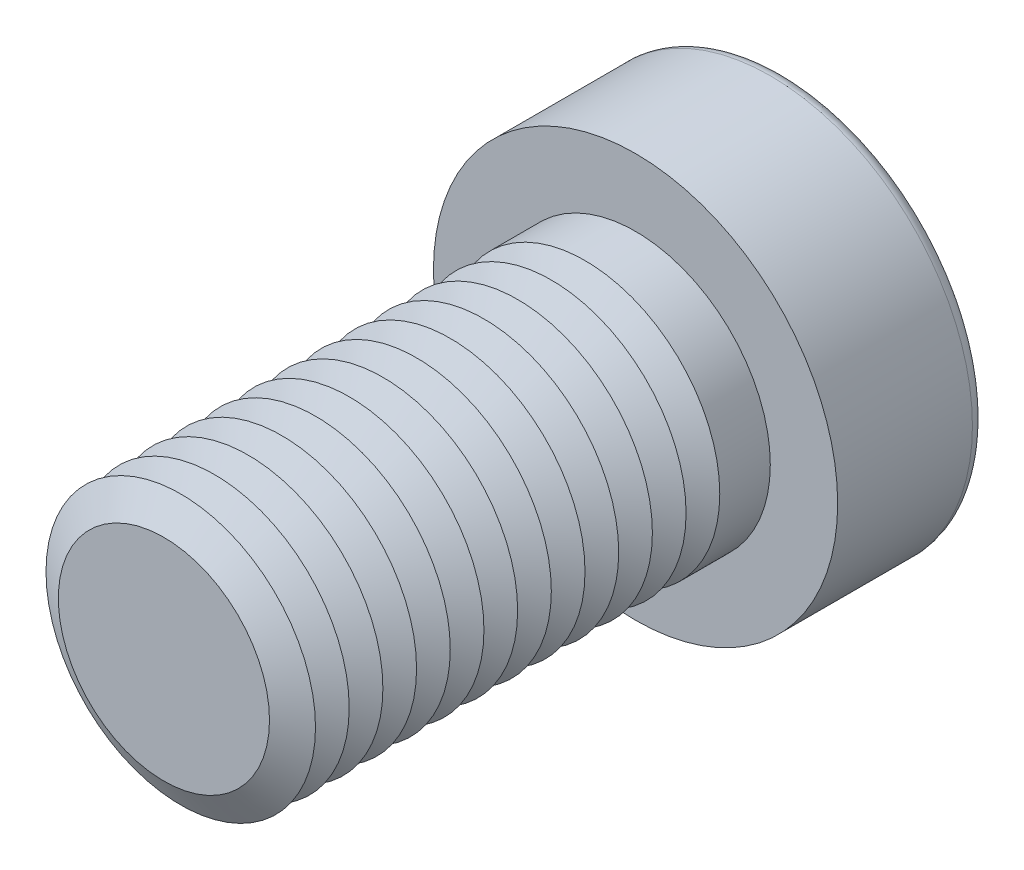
ISO-10303-21;
HEADER;
FILE_DESCRIPTION(('STEP AP214'),'2;1');
FILE_NAME('part.step','',(''),(''),'','','');
FILE_SCHEMA(('AUTOMOTIVE_DESIGN { 1 0 10303 214 1 1 1 1 }'));
ENDSEC;
DATA;
#1=APPLICATION_CONTEXT('core data for automotive mechanical design processes');
#2=APPLICATION_PROTOCOL_DEFINITION('international standard','automotive_design',2000,#1);
#3=PRODUCT_CONTEXT('',#1,'mechanical');
#4=PRODUCT('Part','Part','',(#3));
#5=PRODUCT_RELATED_PRODUCT_CATEGORY('part','',(#4));
#6=PRODUCT_DEFINITION_FORMATION('','',#4);
#7=PRODUCT_DEFINITION_CONTEXT('part definition',#1,'design');
#8=PRODUCT_DEFINITION('design','',#6,#7);
#9=PRODUCT_DEFINITION_SHAPE('','',#8);
#10=(LENGTH_UNIT() NAMED_UNIT(*) SI_UNIT(.MILLI.,.METRE.));
#11=(NAMED_UNIT(*) PLANE_ANGLE_UNIT() SI_UNIT($,.RADIAN.));
#12=(NAMED_UNIT(*) SI_UNIT($,.STERADIAN.) SOLID_ANGLE_UNIT());
#13=UNCERTAINTY_MEASURE_WITH_UNIT(LENGTH_MEASURE(1.E-05),#10,'distance_accuracy_value','');
#14=(GEOMETRIC_REPRESENTATION_CONTEXT(3) GLOBAL_UNCERTAINTY_ASSIGNED_CONTEXT((#13)) GLOBAL_UNIT_ASSIGNED_CONTEXT((#10,
#11,#12)) REPRESENTATION_CONTEXT('',''));
#15=CARTESIAN_POINT('',(0.,0.,0.));
#16=DIRECTION('',(0.,0.,1.));
#17=DIRECTION('',(1.,0.,0.));
#18=AXIS2_PLACEMENT_3D('',#15,#16,#17);
#19=CARTESIAN_POINT('',(0.,0.,26.25));
#20=DIRECTION('',(0.,0.,1.));
#21=DIRECTION('',(1.,0.,0.));
#22=AXIS2_PLACEMENT_3D('',#19,#20,#21);
#23=CONICAL_SURFACE('',#22,10.,1.0471975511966);
#24=CARTESIAN_POINT('',(0.,0.,25.));
#25=DIRECTION('',(0.,0.,1.));
#26=DIRECTION('',(1.,0.,0.));
#27=AXIS2_PLACEMENT_3D('',#24,#25,#26);
#28=CIRCLE('',#27,7.8349364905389);
#29=CARTESIAN_POINT('',(7.8349364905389,0.,25.));
#30=VERTEX_POINT('',#29);
#31=EDGE_CURVE('E313',#30,#30,#28,.T.);
#32=ORIENTED_EDGE('',*,*,#31,.T.);
#33=EDGE_LOOP('',(#32));
#34=FACE_BOUND('',#33,.T.);
#35=CARTESIAN_POINT('',(0.,0.,26.25));
#36=DIRECTION('',(0.,0.,1.));
#37=DIRECTION('',(1.,0.,0.));
#38=AXIS2_PLACEMENT_3D('',#35,#36,#37);
#39=CIRCLE('',#38,10.);
#40=CARTESIAN_POINT('',(10.,0.,26.25));
#41=VERTEX_POINT('',#40);
#42=EDGE_CURVE('E316',#41,#41,#39,.T.);
#43=ORIENTED_EDGE('',*,*,#42,.F.);
#44=EDGE_LOOP('',(#43));
#45=FACE_BOUND('',#44,.T.);
#46=ADVANCED_FACE('F39',(#34,#45),#23,.T.);
#47=CARTESIAN_POINT('',(0.,0.,25.));
#48=DIRECTION('',(0.,0.,-1.));
#49=DIRECTION('',(-1.,0.,0.));
#50=AXIS2_PLACEMENT_3D('',#47,#48,#49);
#51=CONICAL_SURFACE('',#50,7.8349364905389,1.0471975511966);
#52=CARTESIAN_POINT('',(0.,0.,23.75));
#53=DIRECTION('',(0.,0.,1.));
#54=DIRECTION('',(1.,0.,0.));
#55=AXIS2_PLACEMENT_3D('',#52,#53,#54);
#56=CIRCLE('',#55,10.);
#57=CARTESIAN_POINT('',(10.,0.,23.75));
#58=VERTEX_POINT('',#57);
#59=EDGE_CURVE('E324',#58,#58,#56,.T.);
#60=ORIENTED_EDGE('',*,*,#59,.T.);
#61=EDGE_LOOP('',(#60));
#62=FACE_BOUND('',#61,.T.);
#63=ORIENTED_EDGE('',*,*,#31,.F.);
#64=EDGE_LOOP('',(#63));
#65=FACE_BOUND('',#64,.T.);
#66=ADVANCED_FACE('F245',(#62,#65),#51,.T.);
#67=CARTESIAN_POINT('',(0.,0.,35.));
#68=DIRECTION('',(0.,0.,1.));
#69=DIRECTION('',(1.,0.,0.));
#70=AXIS2_PLACEMENT_3D('',#67,#68,#69);
#71=PLANE('',#70);
#72=CARTESIAN_POINT('',(0.,0.,35.));
#73=DIRECTION('',(0.,0.,1.));
#74=DIRECTION('',(1.,0.,0.));
#75=AXIS2_PLACEMENT_3D('',#72,#73,#74);
#76=CIRCLE('',#75,7.8349364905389);
#77=CARTESIAN_POINT('',(7.8349364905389,0.,35.));
#78=VERTEX_POINT('',#77);
#79=EDGE_CURVE('E174',#78,#78,#76,.T.);
#80=ORIENTED_EDGE('',*,*,#79,.T.);
#81=EDGE_LOOP('',(#80));
#82=FACE_BOUND('',#81,.T.);
#83=ADVANCED_FACE('F251',(#82),#71,.T.);
#84=CARTESIAN_POINT('',(0.,0.,35.));
#85=DIRECTION('',(0.,0.,-1.));
#86=DIRECTION('',(-1.,0.,0.));
#87=AXIS2_PLACEMENT_3D('',#84,#85,#86);
#88=CONICAL_SURFACE('',#87,7.8349364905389,1.0471975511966);
#89=CARTESIAN_POINT('',(0.,0.,33.75));
#90=DIRECTION('',(0.,0.,1.));
#91=DIRECTION('',(1.,0.,0.));
#92=AXIS2_PLACEMENT_3D('',#89,#90,#91);
#93=CIRCLE('',#92,10.);
#94=CARTESIAN_POINT('',(10.,0.,33.75));
#95=VERTEX_POINT('',#94);
#96=EDGE_CURVE('E291',#95,#95,#93,.T.);
#97=ORIENTED_EDGE('',*,*,#96,.T.);
#98=EDGE_LOOP('',(#97));
#99=FACE_BOUND('',#98,.T.);
#100=ORIENTED_EDGE('',*,*,#79,.F.);
#101=EDGE_LOOP('',(#100));
#102=FACE_BOUND('',#101,.T.);
#103=ADVANCED_FACE('F199',(#99,#102),#88,.T.);
#104=CARTESIAN_POINT('',(0.,0.,33.75));
#105=DIRECTION('',(0.,0.,1.));
#106=DIRECTION('',(1.,0.,0.));
#107=AXIS2_PLACEMENT_3D('',#104,#105,#106);
#108=CONICAL_SURFACE('',#107,10.,1.0471975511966);
#109=CARTESIAN_POINT('',(0.,0.,32.5));
#110=DIRECTION('',(0.,0.,1.));
#111=DIRECTION('',(1.,0.,0.));
#112=AXIS2_PLACEMENT_3D('',#109,#110,#111);
#113=CIRCLE('',#112,7.8349364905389);
#114=CARTESIAN_POINT('',(7.8349364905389,0.,32.5));
#115=VERTEX_POINT('',#114);
#116=EDGE_CURVE('E288',#115,#115,#113,.T.);
#117=ORIENTED_EDGE('',*,*,#116,.T.);
#118=EDGE_LOOP('',(#117));
#119=FACE_BOUND('',#118,.T.);
#120=ORIENTED_EDGE('',*,*,#96,.F.);
#121=EDGE_LOOP('',(#120));
#122=FACE_BOUND('',#121,.T.);
#123=ADVANCED_FACE('F277',(#119,#122),#108,.T.);
#124=CARTESIAN_POINT('',(0.,0.,32.5));
#125=DIRECTION('',(0.,0.,-1.));
#126=DIRECTION('',(-1.,0.,0.));
#127=AXIS2_PLACEMENT_3D('',#124,#125,#126);
#128=CONICAL_SURFACE('',#127,7.8349364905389,1.0471975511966);
#129=CARTESIAN_POINT('',(0.,0.,31.25));
#130=DIRECTION('',(0.,0.,1.));
#131=DIRECTION('',(1.,0.,0.));
#132=AXIS2_PLACEMENT_3D('',#129,#130,#131);
#133=CIRCLE('',#132,10.);
#134=CARTESIAN_POINT('',(10.,0.,31.25));
#135=VERTEX_POINT('',#134);
#136=EDGE_CURVE('E300',#135,#135,#133,.T.);
#137=ORIENTED_EDGE('',*,*,#136,.T.);
#138=EDGE_LOOP('',(#137));
#139=FACE_BOUND('',#138,.T.);
#140=ORIENTED_EDGE('',*,*,#116,.F.);
#141=EDGE_LOOP('',(#140));
#142=FACE_BOUND('',#141,.T.);
#143=ADVANCED_FACE('F274',(#139,#142),#128,.T.);
#144=CARTESIAN_POINT('',(0.,0.,31.25));
#145=DIRECTION('',(0.,0.,1.));
#146=DIRECTION('',(1.,0.,0.));
#147=AXIS2_PLACEMENT_3D('',#144,#145,#146);
#148=CONICAL_SURFACE('',#147,10.,1.0471975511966);
#149=CARTESIAN_POINT('',(0.,0.,30.));
#150=DIRECTION('',(0.,0.,1.));
#151=DIRECTION('',(1.,0.,0.));
#152=AXIS2_PLACEMENT_3D('',#149,#150,#151);
#153=CIRCLE('',#152,7.8349364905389);
#154=CARTESIAN_POINT('',(7.8349364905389,0.,30.));
#155=VERTEX_POINT('',#154);
#156=EDGE_CURVE('E293',#155,#155,#153,.T.);
#157=ORIENTED_EDGE('',*,*,#156,.T.);
#158=EDGE_LOOP('',(#157));
#159=FACE_BOUND('',#158,.T.);
#160=ORIENTED_EDGE('',*,*,#136,.F.);
#161=EDGE_LOOP('',(#160));
#162=FACE_BOUND('',#161,.T.);
#163=ADVANCED_FACE('F270',(#159,#162),#148,.T.);
#164=CARTESIAN_POINT('',(0.,0.,30.));
#165=DIRECTION('',(0.,0.,-1.));
#166=DIRECTION('',(-1.,0.,0.));
#167=AXIS2_PLACEMENT_3D('',#164,#165,#166);
#168=CONICAL_SURFACE('',#167,7.8349364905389,1.0471975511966);
#169=CARTESIAN_POINT('',(0.,0.,28.75));
#170=DIRECTION('',(0.,0.,1.));
#171=DIRECTION('',(1.,0.,0.));
#172=AXIS2_PLACEMENT_3D('',#169,#170,#171);
#173=CIRCLE('',#172,10.);
#174=CARTESIAN_POINT('',(10.,0.,28.75));
#175=VERTEX_POINT('',#174);
#176=EDGE_CURVE('E309',#175,#175,#173,.T.);
#177=ORIENTED_EDGE('',*,*,#176,.T.);
#178=EDGE_LOOP('',(#177));
#179=FACE_BOUND('',#178,.T.);
#180=ORIENTED_EDGE('',*,*,#156,.F.);
#181=EDGE_LOOP('',(#180));
#182=FACE_BOUND('',#181,.T.);
#183=ADVANCED_FACE('F266',(#179,#182),#168,.T.);
#184=CARTESIAN_POINT('',(0.,0.,28.75));
#185=DIRECTION('',(0.,0.,1.));
#186=DIRECTION('',(1.,0.,0.));
#187=AXIS2_PLACEMENT_3D('',#184,#185,#186);
#188=CONICAL_SURFACE('',#187,10.,1.0471975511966);
#189=CARTESIAN_POINT('',(0.,0.,27.5));
#190=DIRECTION('',(0.,0.,1.));
#191=DIRECTION('',(1.,0.,0.));
#192=AXIS2_PLACEMENT_3D('',#189,#190,#191);
#193=CIRCLE('',#192,7.8349364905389);
#194=CARTESIAN_POINT('',(7.8349364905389,0.,27.5));
#195=VERTEX_POINT('',#194);
#196=EDGE_CURVE('E306',#195,#195,#193,.T.);
#197=ORIENTED_EDGE('',*,*,#196,.T.);
#198=EDGE_LOOP('',(#197));
#199=FACE_BOUND('',#198,.T.);
#200=ORIENTED_EDGE('',*,*,#176,.F.);
#201=EDGE_LOOP('',(#200));
#202=FACE_BOUND('',#201,.T.);
#203=ADVANCED_FACE('F262',(#199,#202),#188,.T.);
#204=CARTESIAN_POINT('',(0.,0.,27.5));
#205=DIRECTION('',(0.,0.,-1.));
#206=DIRECTION('',(-1.,0.,0.));
#207=AXIS2_PLACEMENT_3D('',#204,#205,#206);
#208=CONICAL_SURFACE('',#207,7.8349364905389,1.0471975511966);
#209=ORIENTED_EDGE('',*,*,#42,.T.);
#210=EDGE_LOOP('',(#209));
#211=FACE_BOUND('',#210,.T.);
#212=ORIENTED_EDGE('',*,*,#196,.F.);
#213=EDGE_LOOP('',(#212));
#214=FACE_BOUND('',#213,.T.);
#215=ADVANCED_FACE('F258',(#211,#214),#208,.T.);
#216=CARTESIAN_POINT('',(0.,0.,23.75));
#217=DIRECTION('',(0.,0.,1.));
#218=DIRECTION('',(1.,0.,0.));
#219=AXIS2_PLACEMENT_3D('',#216,#217,#218);
#220=CONICAL_SURFACE('',#219,10.,1.0471975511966);
#221=CARTESIAN_POINT('',(0.,0.,22.5));
#222=DIRECTION('',(0.,0.,1.));
#223=DIRECTION('',(1.,0.,0.));
#224=AXIS2_PLACEMENT_3D('',#221,#222,#223);
#225=CIRCLE('',#224,7.8349364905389);
#226=CARTESIAN_POINT('',(7.8349364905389,0.,22.5));
#227=VERTEX_POINT('',#226);
#228=EDGE_CURVE('E320',#227,#227,#225,.T.);
#229=ORIENTED_EDGE('',*,*,#228,.T.);
#230=EDGE_LOOP('',(#229));
#231=FACE_BOUND('',#230,.T.);
#232=ORIENTED_EDGE('',*,*,#59,.F.);
#233=EDGE_LOOP('',(#232));
#234=FACE_BOUND('',#233,.T.);
#235=ADVANCED_FACE('F261',(#231,#234),#220,.T.);
#236=CARTESIAN_POINT('',(0.,0.,22.5));
#237=DIRECTION('',(0.,0.,-1.));
#238=DIRECTION('',(-1.,0.,0.));
#239=AXIS2_PLACEMENT_3D('',#236,#237,#238);
#240=CONICAL_SURFACE('',#239,7.8349364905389,1.0471975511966);
#241=CARTESIAN_POINT('',(0.,0.,21.25));
#242=DIRECTION('',(0.,0.,1.));
#243=DIRECTION('',(1.,0.,0.));
#244=AXIS2_PLACEMENT_3D('',#241,#242,#243);
#245=CIRCLE('',#244,10.);
#246=CARTESIAN_POINT('',(10.,0.,21.25));
#247=VERTEX_POINT('',#246);
#248=EDGE_CURVE('E331',#247,#247,#245,.T.);
#249=ORIENTED_EDGE('',*,*,#248,.T.);
#250=EDGE_LOOP('',(#249));
#251=FACE_BOUND('',#250,.T.);
#252=ORIENTED_EDGE('',*,*,#228,.F.);
#253=EDGE_LOOP('',(#252));
#254=FACE_BOUND('',#253,.T.);
#255=ADVANCED_FACE('F449',(#251,#254),#240,.T.);
#256=CARTESIAN_POINT('',(0.,0.,21.25));
#257=DIRECTION('',(0.,0.,1.));
#258=DIRECTION('',(1.,0.,0.));
#259=AXIS2_PLACEMENT_3D('',#256,#257,#258);
#260=CONICAL_SURFACE('',#259,10.,1.0471975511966);
#261=CARTESIAN_POINT('',(0.,0.,20.));
#262=DIRECTION('',(0.,0.,1.));
#263=DIRECTION('',(1.,0.,0.));
#264=AXIS2_PLACEMENT_3D('',#261,#262,#263);
#265=CIRCLE('',#264,7.8349364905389);
#266=CARTESIAN_POINT('',(7.8349364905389,0.,20.));
#267=VERTEX_POINT('',#266);
#268=EDGE_CURVE('E328',#267,#267,#265,.T.);
#269=ORIENTED_EDGE('',*,*,#268,.T.);
#270=EDGE_LOOP('',(#269));
#271=FACE_BOUND('',#270,.T.);
#272=ORIENTED_EDGE('',*,*,#248,.F.);
#273=EDGE_LOOP('',(#272));
#274=FACE_BOUND('',#273,.T.);
#275=ADVANCED_FACE('F445',(#271,#274),#260,.T.);
#276=CARTESIAN_POINT('',(0.,0.,20.));
#277=DIRECTION('',(0.,0.,-1.));
#278=DIRECTION('',(-1.,0.,0.));
#279=AXIS2_PLACEMENT_3D('',#276,#277,#278);
#280=CONICAL_SURFACE('',#279,7.8349364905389,1.0471975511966);
#281=CARTESIAN_POINT('',(0.,0.,18.75));
#282=DIRECTION('',(0.,0.,1.));
#283=DIRECTION('',(1.,0.,0.));
#284=AXIS2_PLACEMENT_3D('',#281,#282,#283);
#285=CIRCLE('',#284,10.);
#286=CARTESIAN_POINT('',(10.,0.,18.75));
#287=VERTEX_POINT('',#286);
#288=EDGE_CURVE('E339',#287,#287,#285,.T.);
#289=ORIENTED_EDGE('',*,*,#288,.T.);
#290=EDGE_LOOP('',(#289));
#291=FACE_BOUND('',#290,.T.);
#292=ORIENTED_EDGE('',*,*,#268,.F.);
#293=EDGE_LOOP('',(#292));
#294=FACE_BOUND('',#293,.T.);
#295=ADVANCED_FACE('F441',(#291,#294),#280,.T.);
#296=CARTESIAN_POINT('',(0.,0.,18.75));
#297=DIRECTION('',(0.,0.,1.));
#298=DIRECTION('',(1.,0.,0.));
#299=AXIS2_PLACEMENT_3D('',#296,#297,#298);
#300=CONICAL_SURFACE('',#299,10.,1.0471975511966);
#301=CARTESIAN_POINT('',(0.,0.,17.5));
#302=DIRECTION('',(0.,0.,1.));
#303=DIRECTION('',(1.,0.,0.));
#304=AXIS2_PLACEMENT_3D('',#301,#302,#303);
#305=CIRCLE('',#304,7.8349364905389);
#306=CARTESIAN_POINT('',(7.8349364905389,0.,17.5));
#307=VERTEX_POINT('',#306);
#308=EDGE_CURVE('E335',#307,#307,#305,.T.);
#309=ORIENTED_EDGE('',*,*,#308,.T.);
#310=EDGE_LOOP('',(#309));
#311=FACE_BOUND('',#310,.T.);
#312=ORIENTED_EDGE('',*,*,#288,.F.);
#313=EDGE_LOOP('',(#312));
#314=FACE_BOUND('',#313,.T.);
#315=ADVANCED_FACE('F437',(#311,#314),#300,.T.);
#316=CARTESIAN_POINT('',(0.,0.,17.5));
#317=DIRECTION('',(0.,0.,-1.));
#318=DIRECTION('',(-1.,0.,0.));
#319=AXIS2_PLACEMENT_3D('',#316,#317,#318);
#320=CONICAL_SURFACE('',#319,7.8349364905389,1.0471975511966);
#321=CARTESIAN_POINT('',(0.,0.,16.25));
#322=DIRECTION('',(0.,0.,1.));
#323=DIRECTION('',(1.,0.,0.));
#324=AXIS2_PLACEMENT_3D('',#321,#322,#323);
#325=CIRCLE('',#324,10.);
#326=CARTESIAN_POINT('',(10.,0.,16.25));
#327=VERTEX_POINT('',#326);
#328=EDGE_CURVE('E347',#327,#327,#325,.T.);
#329=ORIENTED_EDGE('',*,*,#328,.T.);
#330=EDGE_LOOP('',(#329));
#331=FACE_BOUND('',#330,.T.);
#332=ORIENTED_EDGE('',*,*,#308,.F.);
#333=EDGE_LOOP('',(#332));
#334=FACE_BOUND('',#333,.T.);
#335=ADVANCED_FACE('F433',(#331,#334),#320,.T.);
#336=CARTESIAN_POINT('',(0.,0.,16.25));
#337=DIRECTION('',(0.,0.,1.));
#338=DIRECTION('',(1.,0.,0.));
#339=AXIS2_PLACEMENT_3D('',#336,#337,#338);
#340=CONICAL_SURFACE('',#339,10.,1.0471975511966);
#341=CARTESIAN_POINT('',(0.,0.,15.));
#342=DIRECTION('',(0.,0.,1.));
#343=DIRECTION('',(1.,0.,0.));
#344=AXIS2_PLACEMENT_3D('',#341,#342,#343);
#345=CIRCLE('',#344,7.8349364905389);
#346=CARTESIAN_POINT('',(7.8349364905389,0.,15.));
#347=VERTEX_POINT('',#346);
#348=EDGE_CURVE('E343',#347,#347,#345,.T.);
#349=ORIENTED_EDGE('',*,*,#348,.T.);
#350=EDGE_LOOP('',(#349));
#351=FACE_BOUND('',#350,.T.);
#352=ORIENTED_EDGE('',*,*,#328,.F.);
#353=EDGE_LOOP('',(#352));
#354=FACE_BOUND('',#353,.T.);
#355=ADVANCED_FACE('F429',(#351,#354),#340,.T.);
#356=CARTESIAN_POINT('',(0.,0.,15.));
#357=DIRECTION('',(0.,0.,-1.));
#358=DIRECTION('',(-1.,0.,0.));
#359=AXIS2_PLACEMENT_3D('',#356,#357,#358);
#360=CONICAL_SURFACE('',#359,7.8349364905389,1.0471975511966);
#361=CARTESIAN_POINT('',(0.,0.,13.75));
#362=DIRECTION('',(0.,0.,1.));
#363=DIRECTION('',(1.,0.,0.));
#364=AXIS2_PLACEMENT_3D('',#361,#362,#363);
#365=CIRCLE('',#364,10.);
#366=CARTESIAN_POINT('',(10.,0.,13.75));
#367=VERTEX_POINT('',#366);
#368=EDGE_CURVE('E355',#367,#367,#365,.T.);
#369=ORIENTED_EDGE('',*,*,#368,.T.);
#370=EDGE_LOOP('',(#369));
#371=FACE_BOUND('',#370,.T.);
#372=ORIENTED_EDGE('',*,*,#348,.F.);
#373=EDGE_LOOP('',(#372));
#374=FACE_BOUND('',#373,.T.);
#375=ADVANCED_FACE('F425',(#371,#374),#360,.T.);
#376=CARTESIAN_POINT('',(0.,0.,13.75));
#377=DIRECTION('',(0.,0.,1.));
#378=DIRECTION('',(1.,0.,0.));
#379=AXIS2_PLACEMENT_3D('',#376,#377,#378);
#380=CONICAL_SURFACE('',#379,10.,1.0471975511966);
#381=CARTESIAN_POINT('',(0.,0.,12.5));
#382=DIRECTION('',(0.,0.,1.));
#383=DIRECTION('',(1.,0.,0.));
#384=AXIS2_PLACEMENT_3D('',#381,#382,#383);
#385=CIRCLE('',#384,7.8349364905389);
#386=CARTESIAN_POINT('',(7.8349364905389,0.,12.5));
#387=VERTEX_POINT('',#386);
#388=EDGE_CURVE('E351',#387,#387,#385,.T.);
#389=ORIENTED_EDGE('',*,*,#388,.T.);
#390=EDGE_LOOP('',(#389));
#391=FACE_BOUND('',#390,.T.);
#392=ORIENTED_EDGE('',*,*,#368,.F.);
#393=EDGE_LOOP('',(#392));
#394=FACE_BOUND('',#393,.T.);
#395=ADVANCED_FACE('F421',(#391,#394),#380,.T.);
#396=CARTESIAN_POINT('',(0.,0.,12.5));
#397=DIRECTION('',(0.,0.,-1.));
#398=DIRECTION('',(-1.,0.,0.));
#399=AXIS2_PLACEMENT_3D('',#396,#397,#398);
#400=CONICAL_SURFACE('',#399,7.8349364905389,1.0471975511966);
#401=CARTESIAN_POINT('',(0.,0.,11.25));
#402=DIRECTION('',(0.,0.,1.));
#403=DIRECTION('',(1.,0.,0.));
#404=AXIS2_PLACEMENT_3D('',#401,#402,#403);
#405=CIRCLE('',#404,10.);
#406=CARTESIAN_POINT('',(10.,0.,11.25));
#407=VERTEX_POINT('',#406);
#408=EDGE_CURVE('E363',#407,#407,#405,.T.);
#409=ORIENTED_EDGE('',*,*,#408,.T.);
#410=EDGE_LOOP('',(#409));
#411=FACE_BOUND('',#410,.T.);
#412=ORIENTED_EDGE('',*,*,#388,.F.);
#413=EDGE_LOOP('',(#412));
#414=FACE_BOUND('',#413,.T.);
#415=ADVANCED_FACE('F417',(#411,#414),#400,.T.);
#416=CARTESIAN_POINT('',(0.,0.,11.25));
#417=DIRECTION('',(0.,0.,1.));
#418=DIRECTION('',(1.,0.,0.));
#419=AXIS2_PLACEMENT_3D('',#416,#417,#418);
#420=CONICAL_SURFACE('',#419,10.,1.0471975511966);
#421=CARTESIAN_POINT('',(0.,0.,10.));
#422=DIRECTION('',(0.,0.,1.));
#423=DIRECTION('',(1.,0.,0.));
#424=AXIS2_PLACEMENT_3D('',#421,#422,#423);
#425=CIRCLE('',#424,7.8349364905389);
#426=CARTESIAN_POINT('',(7.8349364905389,0.,10.));
#427=VERTEX_POINT('',#426);
#428=EDGE_CURVE('E359',#427,#427,#425,.T.);
#429=ORIENTED_EDGE('',*,*,#428,.T.);
#430=EDGE_LOOP('',(#429));
#431=FACE_BOUND('',#430,.T.);
#432=ORIENTED_EDGE('',*,*,#408,.F.);
#433=EDGE_LOOP('',(#432));
#434=FACE_BOUND('',#433,.T.);
#435=ADVANCED_FACE('F413',(#431,#434),#420,.T.);
#436=CARTESIAN_POINT('',(0.,0.,10.));
#437=DIRECTION('',(0.,0.,-1.));
#438=DIRECTION('',(-1.,0.,0.));
#439=AXIS2_PLACEMENT_3D('',#436,#437,#438);
#440=CONICAL_SURFACE('',#439,7.8349364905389,1.0471975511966);
#441=CARTESIAN_POINT('',(0.,0.,8.75));
#442=DIRECTION('',(0.,0.,1.));
#443=DIRECTION('',(1.,0.,0.));
#444=AXIS2_PLACEMENT_3D('',#441,#442,#443);
#445=CIRCLE('',#444,10.);
#446=CARTESIAN_POINT('',(10.,0.,8.75));
#447=VERTEX_POINT('',#446);
#448=EDGE_CURVE('E371',#447,#447,#445,.T.);
#449=ORIENTED_EDGE('',*,*,#448,.T.);
#450=EDGE_LOOP('',(#449));
#451=FACE_BOUND('',#450,.T.);
#452=ORIENTED_EDGE('',*,*,#428,.F.);
#453=EDGE_LOOP('',(#452));
#454=FACE_BOUND('',#453,.T.);
#455=ADVANCED_FACE('F409',(#451,#454),#440,.T.);
#456=CARTESIAN_POINT('',(0.,0.,8.75));
#457=DIRECTION('',(0.,0.,1.));
#458=DIRECTION('',(1.,0.,0.));
#459=AXIS2_PLACEMENT_3D('',#456,#457,#458);
#460=CONICAL_SURFACE('',#459,10.,1.0471975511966);
#461=CARTESIAN_POINT('',(0.,0.,7.5));
#462=DIRECTION('',(0.,0.,1.));
#463=DIRECTION('',(1.,0.,0.));
#464=AXIS2_PLACEMENT_3D('',#461,#462,#463);
#465=CIRCLE('',#464,7.8349364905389);
#466=CARTESIAN_POINT('',(7.8349364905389,0.,7.5));
#467=VERTEX_POINT('',#466);
#468=EDGE_CURVE('E367',#467,#467,#465,.T.);
#469=ORIENTED_EDGE('',*,*,#468,.T.);
#470=EDGE_LOOP('',(#469));
#471=FACE_BOUND('',#470,.T.);
#472=ORIENTED_EDGE('',*,*,#448,.F.);
#473=EDGE_LOOP('',(#472));
#474=FACE_BOUND('',#473,.T.);
#475=ADVANCED_FACE('F404',(#471,#474),#460,.T.);
#476=CARTESIAN_POINT('',(0.,0.,7.5));
#477=DIRECTION('',(0.,0.,-1.));
#478=DIRECTION('',(-1.,0.,0.));
#479=AXIS2_PLACEMENT_3D('',#476,#477,#478);
#480=CONICAL_SURFACE('',#479,7.8349364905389,1.0471975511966);
#481=CARTESIAN_POINT('',(0.,0.,6.25000000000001));
#482=DIRECTION('',(0.,0.,1.));
#483=DIRECTION('',(1.,0.,0.));
#484=AXIS2_PLACEMENT_3D('',#481,#482,#483);
#485=CIRCLE('',#484,10.);
#486=CARTESIAN_POINT('',(10.,0.,6.25000000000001));
#487=VERTEX_POINT('',#486);
#488=EDGE_CURVE('E383',#487,#487,#485,.T.);
#489=ORIENTED_EDGE('',*,*,#488,.T.);
#490=EDGE_LOOP('',(#489));
#491=FACE_BOUND('',#490,.T.);
#492=ORIENTED_EDGE('',*,*,#468,.F.);
#493=EDGE_LOOP('',(#492));
#494=FACE_BOUND('',#493,.T.);
#495=ADVANCED_FACE('F390',(#491,#494),#480,.T.);
#496=CARTESIAN_POINT('',(0.,0.,6.25000000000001));
#497=DIRECTION('',(0.,0.,1.));
#498=DIRECTION('',(1.,0.,0.));
#499=AXIS2_PLACEMENT_3D('',#496,#497,#498);
#500=CONICAL_SURFACE('',#499,10.,1.0471975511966);
#501=CARTESIAN_POINT('',(0.,0.,5.));
#502=DIRECTION('',(0.,0.,1.));
#503=DIRECTION('',(1.,0.,0.));
#504=AXIS2_PLACEMENT_3D('',#501,#502,#503);
#505=CIRCLE('',#504,7.8349364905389);
#506=CARTESIAN_POINT('',(7.8349364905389,0.,5.));
#507=VERTEX_POINT('',#506);
#508=EDGE_CURVE('E375',#507,#507,#505,.T.);
#509=ORIENTED_EDGE('',*,*,#508,.T.);
#510=EDGE_LOOP('',(#509));
#511=FACE_BOUND('',#510,.T.);
#512=ORIENTED_EDGE('',*,*,#488,.F.);
#513=EDGE_LOOP('',(#512));
#514=FACE_BOUND('',#513,.T.);
#515=ADVANCED_FACE('F393',(#511,#514),#500,.T.);
#516=CARTESIAN_POINT('',(0.,0.,5.));
#517=DIRECTION('',(0.,0.,-1.));
#518=DIRECTION('',(-1.,0.,0.));
#519=AXIS2_PLACEMENT_3D('',#516,#517,#518);
#520=CONICAL_SURFACE('',#519,7.8349364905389,1.0471975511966);
#521=CARTESIAN_POINT('',(0.,0.,3.75));
#522=DIRECTION('',(0.,0.,1.));
#523=DIRECTION('',(1.,0.,0.));
#524=AXIS2_PLACEMENT_3D('',#521,#522,#523);
#525=CIRCLE('',#524,10.);
#526=CARTESIAN_POINT('',(10.,0.,3.75));
#527=VERTEX_POINT('',#526);
#528=EDGE_CURVE('E379',#527,#527,#525,.T.);
#529=ORIENTED_EDGE('',*,*,#528,.T.);
#530=EDGE_LOOP('',(#529));
#531=FACE_BOUND('',#530,.T.);
#532=ORIENTED_EDGE('',*,*,#508,.F.);
#533=EDGE_LOOP('',(#532));
#534=FACE_BOUND('',#533,.T.);
#535=ADVANCED_FACE('F395',(#531,#534),#520,.T.);
#536=CARTESIAN_POINT('',(0.,0.,-0.499999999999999));
#537=DIRECTION('',(0.,0.,-1.));
#538=DIRECTION('',(-1.,0.,0.));
#539=AXIS2_PLACEMENT_3D('',#536,#537,#538);
#540=CONICAL_SURFACE('',#539,7.,1.0471975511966);
#541=CARTESIAN_POINT('',(0.,0.,3.54145188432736));
#542=VERTEX_POINT('',#541);
#543=VERTEX_LOOP('',#542);
#544=FACE_BOUND('',#543,.T.);
#545=CARTESIAN_POINT('',(0.,0.,-0.499999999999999));
#546=DIRECTION('',(0.,0.,-1.));
#547=DIRECTION('',(-1.,0.,0.));
#548=AXIS2_PLACEMENT_3D('',#545,#546,#547);
#549=CIRCLE('',#548,7.);
#550=CARTESIAN_POINT('',(-6.06217782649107,3.5,-0.499999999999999));
#551=VERTEX_POINT('',#550);
#552=CARTESIAN_POINT('',(0.,7.,-0.499999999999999));
#553=VERTEX_POINT('',#552);
#554=EDGE_CURVE('E149',#551,#553,#549,.T.);
#555=ORIENTED_EDGE('',*,*,#554,.T.);
#556=CARTESIAN_POINT('',(0.,0.,-0.499999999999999));
#557=DIRECTION('',(0.,0.,-1.));
#558=DIRECTION('',(-1.,0.,0.));
#559=AXIS2_PLACEMENT_3D('',#556,#557,#558);
#560=CIRCLE('',#559,7.);
#561=CARTESIAN_POINT('',(6.06217782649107,3.5,-0.499999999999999));
#562=VERTEX_POINT('',#561);
#563=EDGE_CURVE('E54',#553,#562,#560,.T.);
#564=ORIENTED_EDGE('',*,*,#563,.T.);
#565=CARTESIAN_POINT('',(6.06217782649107,-3.5,-0.499999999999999));
#566=VERTEX_POINT('',#565);
#567=EDGE_CURVE('E906',#562,#566,#560,.T.);
#568=ORIENTED_EDGE('',*,*,#567,.T.);
#569=CARTESIAN_POINT('',(0.,-7.,-0.499999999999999));
#570=VERTEX_POINT('',#569);
#571=EDGE_CURVE('E904',#566,#570,#560,.T.);
#572=ORIENTED_EDGE('',*,*,#571,.T.);
#573=CARTESIAN_POINT('',(-6.06217782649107,-3.5,-0.499999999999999));
#574=VERTEX_POINT('',#573);
#575=EDGE_CURVE('E899',#570,#574,#560,.T.);
#576=ORIENTED_EDGE('',*,*,#575,.T.);
#577=EDGE_CURVE('E897',#574,#551,#560,.T.);
#578=ORIENTED_EDGE('',*,*,#577,.T.);
#579=EDGE_LOOP('',(#555,#564,#568,#572,#576,#578));
#580=FACE_BOUND('',#579,.T.);
#581=ADVANCED_FACE('F201',(#544,#580),#540,.F.);
#582=CARTESIAN_POINT('',(0.,0.,-0.499999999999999));
#583=DIRECTION('',(0.,0.,-1.));
#584=DIRECTION('',(-1.,0.,0.));
#585=AXIS2_PLACEMENT_3D('',#582,#583,#584);
#586=PLANE('',#585);
#587=ORIENTED_EDGE('',*,*,#563,.F.);
#588=DIRECTION('',(1.,0.,0.));
#589=VECTOR('',#588,1.);
#590=CARTESIAN_POINT('',(-4.04145188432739,7.,-0.499999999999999));
#591=LINE('',#590,#589);
#592=CARTESIAN_POINT('',(4.04145188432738,7.,-0.499999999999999));
#593=VERTEX_POINT('',#592);
#594=EDGE_CURVE('E947',#553,#593,#591,.T.);
#595=ORIENTED_EDGE('',*,*,#594,.T.);
#596=DIRECTION('',(0.5,-0.866025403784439,0.));
#597=VECTOR('',#596,1.);
#598=CARTESIAN_POINT('',(4.04145188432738,7.,-0.499999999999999));
#599=LINE('',#598,#597);
#600=EDGE_CURVE('E155',#593,#562,#599,.T.);
#601=ORIENTED_EDGE('',*,*,#600,.T.);
#602=EDGE_LOOP('',(#587,#595,#601));
#603=FACE_BOUND('',#602,.T.);
#604=ADVANCED_FACE('F520',(#603),#586,.T.);
#605=ORIENTED_EDGE('',*,*,#567,.F.);
#606=CARTESIAN_POINT('',(8.08290376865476,0.,-0.499999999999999));
#607=VERTEX_POINT('',#606);
#608=EDGE_CURVE('E946',#562,#607,#599,.T.);
#609=ORIENTED_EDGE('',*,*,#608,.T.);
#610=DIRECTION('',(-0.5,-0.866025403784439,0.));
#611=VECTOR('',#610,1.);
#612=CARTESIAN_POINT('',(8.08290376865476,0.,-0.499999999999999));
#613=LINE('',#612,#611);
#614=EDGE_CURVE('E920',#607,#566,#613,.T.);
#615=ORIENTED_EDGE('',*,*,#614,.T.);
#616=EDGE_LOOP('',(#605,#609,#615));
#617=FACE_BOUND('',#616,.T.);
#618=ADVANCED_FACE('F530',(#617),#586,.T.);
#619=ORIENTED_EDGE('',*,*,#571,.F.);
#620=CARTESIAN_POINT('',(4.04145188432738,-7.,-0.499999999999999));
#621=VERTEX_POINT('',#620);
#622=EDGE_CURVE('E922',#566,#621,#613,.T.);
#623=ORIENTED_EDGE('',*,*,#622,.T.);
#624=DIRECTION('',(-1.,0.,0.));
#625=VECTOR('',#624,1.);
#626=CARTESIAN_POINT('',(4.04145188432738,-7.,-0.499999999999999));
#627=LINE('',#626,#625);
#628=EDGE_CURVE('E871',#621,#570,#627,.T.);
#629=ORIENTED_EDGE('',*,*,#628,.T.);
#630=EDGE_LOOP('',(#619,#623,#629));
#631=FACE_BOUND('',#630,.T.);
#632=ADVANCED_FACE('F540',(#631),#586,.T.);
#633=ORIENTED_EDGE('',*,*,#575,.F.);
#634=CARTESIAN_POINT('',(-4.04145188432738,-7.,-0.499999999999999));
#635=VERTEX_POINT('',#634);
#636=EDGE_CURVE('E916',#570,#635,#627,.T.);
#637=ORIENTED_EDGE('',*,*,#636,.T.);
#638=DIRECTION('',(-0.5,0.866025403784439,0.));
#639=VECTOR('',#638,1.);
#640=CARTESIAN_POINT('',(-4.04145188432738,-7.,-0.499999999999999));
#641=LINE('',#640,#639);
#642=EDGE_CURVE('E918',#635,#574,#641,.T.);
#643=ORIENTED_EDGE('',*,*,#642,.T.);
#644=EDGE_LOOP('',(#633,#637,#643));
#645=FACE_BOUND('',#644,.T.);
#646=ADVANCED_FACE('F548',(#645),#586,.T.);
#647=ORIENTED_EDGE('',*,*,#577,.F.);
#648=CARTESIAN_POINT('',(-8.08290376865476,0.,-0.499999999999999));
#649=VERTEX_POINT('',#648);
#650=EDGE_CURVE('E924',#574,#649,#641,.T.);
#651=ORIENTED_EDGE('',*,*,#650,.T.);
#652=DIRECTION('',(0.5,0.866025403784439,0.));
#653=VECTOR('',#652,1.);
#654=CARTESIAN_POINT('',(-8.08290376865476,0.,-0.499999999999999));
#655=LINE('',#654,#653);
#656=EDGE_CURVE('E158',#649,#551,#655,.T.);
#657=ORIENTED_EDGE('',*,*,#656,.T.);
#658=EDGE_LOOP('',(#647,#651,#657));
#659=FACE_BOUND('',#658,.T.);
#660=ADVANCED_FACE('F231',(#659),#586,.T.);
#661=ORIENTED_EDGE('',*,*,#554,.F.);
#662=CARTESIAN_POINT('',(-4.04145188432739,7.,-0.499999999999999));
#663=VERTEX_POINT('',#662);
#664=EDGE_CURVE('E931',#551,#663,#655,.T.);
#665=ORIENTED_EDGE('',*,*,#664,.T.);
#666=EDGE_CURVE('E944',#663,#553,#591,.T.);
#667=ORIENTED_EDGE('',*,*,#666,.T.);
#668=EDGE_LOOP('',(#661,#665,#667));
#669=FACE_BOUND('',#668,.T.);
#670=ADVANCED_FACE('F532',(#669),#586,.T.);
#671=CARTESIAN_POINT('',(-4.04145188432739,7.,-0.499999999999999));
#672=DIRECTION('',(0.,1.,0.));
#673=DIRECTION('',(-1.,0.,0.));
#674=AXIS2_PLACEMENT_3D('',#671,#672,#673);
#675=PLANE('',#674);
#676=DIRECTION('',(0.,0.,-1.));
#677=VECTOR('',#676,1.);
#678=CARTESIAN_POINT('',(-4.04145188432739,7.,-0.499999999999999));
#679=LINE('',#678,#677);
#680=CARTESIAN_POINT('',(-4.04145188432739,7.,-11.));
#681=VERTEX_POINT('',#680);
#682=EDGE_CURVE('E147',#663,#681,#679,.T.);
#683=ORIENTED_EDGE('',*,*,#682,.T.);
#684=CARTESIAN_POINT('',(-10.5504265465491,7.,-12.2268091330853));
#685=CARTESIAN_POINT('',(-10.234342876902,7.,-12.1562549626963));
#686=CARTESIAN_POINT('',(-9.9180575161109,7.,-12.08658775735));
#687=CARTESIAN_POINT('',(-9.28498462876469,7.,-11.9495060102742));
#688=CARTESIAN_POINT('',(-8.9681970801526,7.,-11.8820915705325));
#689=CARTESIAN_POINT('',(-8.33372161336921,7.,-11.7499322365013));
#690=CARTESIAN_POINT('',(-8.01603310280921,7.,-11.6851901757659));
#691=CARTESIAN_POINT('',(-7.37998429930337,7.,-11.5590967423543));
#692=CARTESIAN_POINT('',(-7.0616240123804,7.,-11.4977453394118));
#693=CARTESIAN_POINT('',(-6.42688035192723,7.,-11.3797520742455));
#694=CARTESIAN_POINT('',(-6.1105037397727,7.,-11.3230740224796));
#695=CARTESIAN_POINT('',(-5.47688007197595,7.,-11.2148218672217));
#696=CARTESIAN_POINT('',(-5.15963303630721,7.,-11.163247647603));
#697=CARTESIAN_POINT('',(-4.52422055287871,7.,-11.0663930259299));
#698=CARTESIAN_POINT('',(-4.20605525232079,7.,-11.0211116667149));
#699=CARTESIAN_POINT('',(-3.56871761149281,7.,-10.9382023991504));
#700=CARTESIAN_POINT('',(-3.24954527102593,7.,-10.9005744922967));
#701=CARTESIAN_POINT('',(-2.60663136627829,7.,-10.8340645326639));
#702=CARTESIAN_POINT('',(-2.28287891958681,7.,-10.8052860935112));
#703=CARTESIAN_POINT('',(-1.63459129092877,7.,-10.7584808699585));
#704=CARTESIAN_POINT('',(-1.31005612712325,7.,-10.7404538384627));
#705=CARTESIAN_POINT('',(-0.660675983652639,7.,-10.7162037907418));
#706=CARTESIAN_POINT('',(-0.335831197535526,7.,-10.7099756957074));
#707=CARTESIAN_POINT('',(0.313864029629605,7.,-10.7097025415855));
#708=CARTESIAN_POINT('',(0.63871447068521,7.,-10.71565750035));
#709=CARTESIAN_POINT('',(1.28930456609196,7.,-10.7394217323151));
#710=CARTESIAN_POINT('',(1.61504241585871,7.,-10.7572794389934));
#711=CARTESIAN_POINT('',(2.26573386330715,7.,-10.80384959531));
#712=CARTESIAN_POINT('',(2.59068744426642,7.,-10.8325622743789));
#713=CARTESIAN_POINT('',(3.23981909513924,7.,-10.8994274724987));
#714=CARTESIAN_POINT('',(3.56399652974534,7.,-10.9375860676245));
#715=CARTESIAN_POINT('',(4.2113121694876,7.,-11.0217977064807));
#716=CARTESIAN_POINT('',(4.5344503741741,7.,-11.0678507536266));
#717=CARTESIAN_POINT('',(5.18817201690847,7.,-11.1677070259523));
#718=CARTESIAN_POINT('',(5.51872906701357,7.,-11.2216814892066));
#719=CARTESIAN_POINT('',(6.17890777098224,7.,-11.3351036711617));
#720=CARTESIAN_POINT('',(6.50852939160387,7.,-11.3945515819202));
#721=CARTESIAN_POINT('',(7.16699002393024,7.,-11.517838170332));
#722=CARTESIAN_POINT('',(7.49582892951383,7.,-11.5816774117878));
#723=CARTESIAN_POINT('',(8.15279770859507,7.,-11.7128718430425));
#724=CARTESIAN_POINT('',(8.48092759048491,7.,-11.7802269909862));
#725=CARTESIAN_POINT('',(9.13669969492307,7.,-11.9177935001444));
#726=CARTESIAN_POINT('',(9.46434172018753,7.,-11.9880057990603));
#727=CARTESIAN_POINT('',(10.1191240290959,7.,-12.1307356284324));
#728=CARTESIAN_POINT('',(10.4462643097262,7.,-12.2032531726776));
#729=CARTESIAN_POINT('',(11.4270001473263,7.,-12.4235988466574));
#730=CARTESIAN_POINT('',(12.0799651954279,7.,-12.5742316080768));
#731=CARTESIAN_POINT('',(13.3767589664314,7.,-12.8787334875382));
#732=CARTESIAN_POINT('',(14.0206022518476,7.,-13.0325409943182));
#733=CARTESIAN_POINT('',(15.3074422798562,7.,-13.343715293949));
#734=CARTESIAN_POINT('',(15.9504390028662,7.,-13.5010821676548));
#735=CARTESIAN_POINT('',(17.2348956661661,7.,-13.8181856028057));
#736=CARTESIAN_POINT('',(17.87635649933,7.,-13.9779185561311));
#737=CARTESIAN_POINT('',(19.1587589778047,7.,-14.299358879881));
#738=CARTESIAN_POINT('',(19.7997006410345,7.,-14.4610661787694));
#739=CARTESIAN_POINT('',(20.4404659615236,7.,-14.6234618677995));
#740=B_SPLINE_CURVE_WITH_KNOTS('',3,(#684,#685,#686,#687,#688,#689,#690,#691,#692,#693,#694,
#695,#696,#697,#698,#699,#700,#701,#702,#703,#704,#705,#706,#707,#708,#709,#710,#711,#712,#713,
#714,#715,#716,#717,#718,#719,#720,#721,#722,#723,#724,#725,#726,#727,#728,#729,#730,#731,#732,
#733,#734,#735,#736,#737,#738,#739),.UNSPECIFIED.,.F.,.F.,(4,2,2,2,2,2,2,2,2,2,2,2,2,2,2,2,2,2,
2,2,2,2,2,2,2,2,2,4),(0.,0.971590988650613,1.94322590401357,2.91586589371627,3.88849719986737,
4.85270391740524,5.81688869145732,6.78092664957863,7.74496479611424,8.71989464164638,
9.6948020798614,10.6692897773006,11.6437789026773,12.6222577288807,13.6007572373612,
14.579887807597,15.5590188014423,16.5637656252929,17.5685477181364,18.5734590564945,
19.5783584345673,20.5835903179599,21.588828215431,23.5991368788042,25.585004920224,
27.5709181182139,29.5540636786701,31.5371375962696),.UNSPECIFIED.);
#741=CARTESIAN_POINT('',(4.04145188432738,7.00000000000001,-11.));
#742=VERTEX_POINT('',#741);
#743=EDGE_CURVE('E124',#681,#742,#740,.T.);
#744=ORIENTED_EDGE('',*,*,#743,.T.);
#745=DIRECTION('',(0.,0.,-1.));
#746=VECTOR('',#745,1.);
#747=CARTESIAN_POINT('',(4.04145188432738,7.,-0.499999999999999));
#748=LINE('',#747,#746);
#749=EDGE_CURVE('E143',#593,#742,#748,.T.);
#750=ORIENTED_EDGE('',*,*,#749,.F.);
#751=ORIENTED_EDGE('',*,*,#594,.F.);
#752=ORIENTED_EDGE('',*,*,#666,.F.);
#753=EDGE_LOOP('',(#683,#744,#750,#751,#752));
#754=FACE_BOUND('',#753,.T.);
#755=ADVANCED_FACE('F141',(#754),#675,.F.);
#756=CARTESIAN_POINT('',(4.04145188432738,7.,-0.499999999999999));
#757=DIRECTION('',(0.866025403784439,0.5,0.));
#758=DIRECTION('',(-0.5,0.866025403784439,0.));
#759=AXIS2_PLACEMENT_3D('',#756,#757,#758);
#760=PLANE('',#759);
#761=ORIENTED_EDGE('',*,*,#749,.T.);
#762=CARTESIAN_POINT('',(4.04133641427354,7.0002,-11.0000309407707));
#763=CARTESIAN_POINT('',(4.20917732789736,6.70949101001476,-10.9550391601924));
#764=CARTESIAN_POINT('',(4.37732255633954,6.41825493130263,-10.9141940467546));
#765=CARTESIAN_POINT('',(4.71420683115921,5.83475425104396,-10.8424330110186));
#766=CARTESIAN_POINT('',(4.88294609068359,5.5424892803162,-10.8115211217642));
#767=CARTESIAN_POINT('',(5.21999536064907,4.95870282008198,-10.7614311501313));
#768=CARTESIAN_POINT('',(5.38830309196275,4.66718527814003,-10.7421933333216));
#769=CARTESIAN_POINT('',(5.72513318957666,4.08377843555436,-10.7163973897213));
#770=CARTESIAN_POINT('',(5.89365550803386,3.79188921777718,-10.7098368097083));
#771=CARTESIAN_POINT('',(6.23070014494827,3.20811078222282,-10.7098368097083));
#772=CARTESIAN_POINT('',(6.39922246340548,2.91622156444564,-10.7163973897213));
#773=CARTESIAN_POINT('',(6.73605256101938,2.33281472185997,-10.7421933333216));
#774=CARTESIAN_POINT('',(6.90436029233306,2.04129717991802,-10.7614311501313));
#775=CARTESIAN_POINT('',(7.24140956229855,1.4575107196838,-10.8115211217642));
#776=CARTESIAN_POINT('',(7.41014882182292,1.16524574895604,-10.8424330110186));
#777=CARTESIAN_POINT('',(7.7470330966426,0.581745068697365,-10.9141940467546));
#778=CARTESIAN_POINT('',(7.91517832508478,0.290508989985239,-10.9550391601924));
#779=CARTESIAN_POINT('',(8.0830192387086,-0.000200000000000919,-11.0000309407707));
#780=B_SPLINE_CURVE_WITH_KNOTS('',3,(#762,#763,#764,#765,#766,#767,#768,#769,#770,#771,#772,
#773,#774,#775,#776,#777,#778,#779),.UNSPECIFIED.,.F.,.F.,(4,2,2,2,2,2,2,2,4),(0.,
1.01610389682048,2.03261982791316,3.04388955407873,4.05496356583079,5.06603757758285,
6.07730730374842,7.09382323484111,8.10992713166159),.UNSPECIFIED.);
#781=CARTESIAN_POINT('',(8.08290376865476,0.,-11.));
#782=VERTEX_POINT('',#781);
#783=EDGE_CURVE('E11',#742,#782,#780,.T.);
#784=ORIENTED_EDGE('',*,*,#783,.T.);
#785=DIRECTION('',(0.,0.,-1.));
#786=VECTOR('',#785,1.);
#787=CARTESIAN_POINT('',(8.08290376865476,0.,-0.499999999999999));
#788=LINE('',#787,#786);
#789=EDGE_CURVE('E157',#607,#782,#788,.T.);
#790=ORIENTED_EDGE('',*,*,#789,.F.);
#791=ORIENTED_EDGE('',*,*,#608,.F.);
#792=ORIENTED_EDGE('',*,*,#600,.F.);
#793=EDGE_LOOP('',(#761,#784,#790,#791,#792));
#794=FACE_BOUND('',#793,.T.);
#795=ADVANCED_FACE('F152',(#794),#760,.F.);
#796=CARTESIAN_POINT('',(8.08290376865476,0.,-0.499999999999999));
#797=DIRECTION('',(0.866025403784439,-0.5,0.));
#798=DIRECTION('',(0.5,0.866025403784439,0.));
#799=AXIS2_PLACEMENT_3D('',#796,#797,#798);
#800=PLANE('',#799);
#801=ORIENTED_EDGE('',*,*,#789,.T.);
#802=CARTESIAN_POINT('',(8.0830192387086,0.000199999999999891,-11.0000309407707));
#803=CARTESIAN_POINT('',(7.91517832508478,-0.290508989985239,-10.9550391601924));
#804=CARTESIAN_POINT('',(7.7470330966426,-0.581745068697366,-10.9141940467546));
#805=CARTESIAN_POINT('',(7.41014882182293,-1.16524574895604,-10.8424330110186));
#806=CARTESIAN_POINT('',(7.24140956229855,-1.4575107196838,-10.8115211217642));
#807=CARTESIAN_POINT('',(6.90436029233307,-2.04129717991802,-10.7614311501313));
#808=CARTESIAN_POINT('',(6.73605256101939,-2.33281472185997,-10.7421933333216));
#809=CARTESIAN_POINT('',(6.39922246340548,-2.91622156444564,-10.7163973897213));
#810=CARTESIAN_POINT('',(6.23070014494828,-3.20811078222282,-10.7098368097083));
#811=CARTESIAN_POINT('',(5.89365550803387,-3.79188921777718,-10.7098368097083));
#812=CARTESIAN_POINT('',(5.72513318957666,-4.08377843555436,-10.7163973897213));
#813=CARTESIAN_POINT('',(5.38830309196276,-4.66718527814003,-10.7421933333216));
#814=CARTESIAN_POINT('',(5.21999536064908,-4.95870282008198,-10.7614311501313));
#815=CARTESIAN_POINT('',(4.88294609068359,-5.5424892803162,-10.8115211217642));
#816=CARTESIAN_POINT('',(4.71420683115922,-5.83475425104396,-10.8424330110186));
#817=CARTESIAN_POINT('',(4.37732255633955,-6.41825493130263,-10.9141940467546));
#818=CARTESIAN_POINT('',(4.20917732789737,-6.70949101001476,-10.9550391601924));
#819=CARTESIAN_POINT('',(4.04133641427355,-7.0002,-11.0000309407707));
#820=B_SPLINE_CURVE_WITH_KNOTS('',3,(#802,#803,#804,#805,#806,#807,#808,#809,#810,#811,#812,
#813,#814,#815,#816,#817,#818,#819),.UNSPECIFIED.,.F.,.F.,(4,2,2,2,2,2,2,2,4),(0.,
1.01610389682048,2.03261982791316,3.04388955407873,4.05496356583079,5.06603757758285,
6.07730730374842,7.0938232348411,8.10992713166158),.UNSPECIFIED.);
#821=CARTESIAN_POINT('',(4.04145188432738,-7.,-11.));
#822=VERTEX_POINT('',#821);
#823=EDGE_CURVE('E173',#782,#822,#820,.T.);
#824=ORIENTED_EDGE('',*,*,#823,.T.);
#825=DIRECTION('',(0.,0.,-1.));
#826=VECTOR('',#825,1.);
#827=CARTESIAN_POINT('',(4.04145188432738,-7.,-0.499999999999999));
#828=LINE('',#827,#826);
#829=EDGE_CURVE('E866',#621,#822,#828,.T.);
#830=ORIENTED_EDGE('',*,*,#829,.F.);
#831=ORIENTED_EDGE('',*,*,#622,.F.);
#832=ORIENTED_EDGE('',*,*,#614,.F.);
#833=EDGE_LOOP('',(#801,#824,#830,#831,#832));
#834=FACE_BOUND('',#833,.T.);
#835=ADVANCED_FACE('F191',(#834),#800,.F.);
#836=CARTESIAN_POINT('',(4.04145188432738,-7.,-0.499999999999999));
#837=DIRECTION('',(0.,-1.,0.));
#838=DIRECTION('',(1.,0.,0.));
#839=AXIS2_PLACEMENT_3D('',#836,#837,#838);
#840=PLANE('',#839);
#841=ORIENTED_EDGE('',*,*,#829,.T.);
#842=CARTESIAN_POINT('',(-10.5504265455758,-7.,-12.226809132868));
#843=CARTESIAN_POINT('',(-10.234342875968,-7.,-12.1562549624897));
#844=CARTESIAN_POINT('',(-9.91805751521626,-7.,-12.0865877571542));
#845=CARTESIAN_POINT('',(-9.28498462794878,-7.,-11.9495060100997));
#846=CARTESIAN_POINT('',(-8.96819707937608,-7.,-11.8820915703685));
#847=CARTESIAN_POINT('',(-8.33372161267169,-7.,-11.7499322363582));
#848=CARTESIAN_POINT('',(-8.01603310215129,-7.,-11.6851901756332));
#849=CARTESIAN_POINT('',(-7.37998429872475,-7.,-11.5590967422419));
#850=CARTESIAN_POINT('',(-7.06162401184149,-7.,-11.4977453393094));
#851=CARTESIAN_POINT('',(-6.42688035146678,-7.,-11.3797520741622));
#852=CARTESIAN_POINT('',(-6.110503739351,-7.,-11.3230740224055));
#853=CARTESIAN_POINT('',(-5.47688007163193,-7.,-11.214821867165));
#854=CARTESIAN_POINT('',(-5.15963303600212,-7.,-11.1632476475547));
#855=CARTESIAN_POINT('',(-4.52422055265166,-7.,-11.0663930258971));
#856=CARTESIAN_POINT('',(-4.20605525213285,-7.,-11.0211116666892));
#857=CARTESIAN_POINT('',(-3.56871761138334,-7.,-10.9382023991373));
#858=CARTESIAN_POINT('',(-3.24954527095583,-7.,-10.9005744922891));
#859=CARTESIAN_POINT('',(-2.60663136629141,-7.,-10.8340645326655));
#860=CARTESIAN_POINT('',(-2.28287891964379,-7.,-10.8052860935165));
#861=CARTESIAN_POINT('',(-1.63459129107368,-7.,-10.7584808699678));
#862=CARTESIAN_POINT('',(-1.31005612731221,-7.,-10.7404538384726));
#863=CARTESIAN_POINT('',(-0.660675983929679,-7.,-10.7162037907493));
#864=CARTESIAN_POINT('',(-0.335831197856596,-7.,-10.7099756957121));
#865=CARTESIAN_POINT('',(0.313864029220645,-7.,-10.7097025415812));
#866=CARTESIAN_POINT('',(0.638714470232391,-7.,-10.7156575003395));
#867=CARTESIAN_POINT('',(1.2893045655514,-7.,-10.7394217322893));
#868=CARTESIAN_POINT('',(1.61504241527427,-7.,-10.7572794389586));
#869=CARTESIAN_POINT('',(2.26573386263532,-7.,-10.8038495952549));
#870=CARTESIAN_POINT('',(2.5906874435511,-7.,-10.8325622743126));
#871=CARTESIAN_POINT('',(3.23981909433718,-7.,-10.8994274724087));
#872=CARTESIAN_POINT('',(3.56399652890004,-7.,-10.9375860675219));
#873=CARTESIAN_POINT('',(4.2113121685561,-7.,-11.0217977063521));
#874=CARTESIAN_POINT('',(4.53445037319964,-7.,-11.0678507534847));
#875=CARTESIAN_POINT('',(5.18817201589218,-7.,-11.1677070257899));
#876=CARTESIAN_POINT('',(5.51872906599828,-7.,-11.221681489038));
#877=CARTESIAN_POINT('',(6.17890776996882,-7.,-11.3351036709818));
#878=CARTESIAN_POINT('',(6.50852939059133,-7.,-11.3945515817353));
#879=CARTESIAN_POINT('',(7.16699002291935,-7.,-11.5178381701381));
#880=CARTESIAN_POINT('',(7.49582892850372,-7.,-11.5816774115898));
#881=CARTESIAN_POINT('',(8.1527977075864,-7.,-11.7128718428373));
#882=CARTESIAN_POINT('',(8.4809275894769,-7.,-11.7802269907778));
#883=CARTESIAN_POINT('',(9.13669969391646,-7.,-11.9177934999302));
#884=CARTESIAN_POINT('',(9.46434171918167,-7.,-11.9880057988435));
#885=CARTESIAN_POINT('',(10.1191240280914,-7.,-12.1307356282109));
#886=CARTESIAN_POINT('',(10.4462643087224,-7.,-12.2032531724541));
#887=CARTESIAN_POINT('',(11.4270001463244,-7.,-12.4235988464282));
#888=CARTESIAN_POINT('',(12.079965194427,-7.,-12.5742316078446));
#889=CARTESIAN_POINT('',(13.3767589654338,-7.,-12.8787334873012));
#890=CARTESIAN_POINT('',(14.0206022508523,-7.,-13.0325409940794));
#891=CARTESIAN_POINT('',(15.3074422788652,-7.,-13.3437152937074));
#892=CARTESIAN_POINT('',(15.9504390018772,-7.,-13.501082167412));
#893=CARTESIAN_POINT('',(17.2348956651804,-7.,-13.818185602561));
#894=CARTESIAN_POINT('',(17.8763564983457,-7.,-13.9779185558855));
#895=CARTESIAN_POINT('',(19.1587589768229,-7.,-14.2993588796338));
#896=CARTESIAN_POINT('',(19.7997006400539,-7.,-14.4610661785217));
#897=CARTESIAN_POINT('',(20.4404659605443,-7.,-14.6234618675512));
#898=B_SPLINE_CURVE_WITH_KNOTS('',3,(#842,#843,#844,#845,#846,#847,#848,#849,#850,#851,#852,
#853,#854,#855,#856,#857,#858,#859,#860,#861,#862,#863,#864,#865,#866,#867,#868,#869,#870,#871,
#872,#873,#874,#875,#876,#877,#878,#879,#880,#881,#882,#883,#884,#885,#886,#887,#888,#889,#890,
#891,#892,#893,#894,#895,#896,#897),.UNSPECIFIED.,.F.,.F.,(4,2,2,2,2,2,2,2,2,2,2,2,2,2,2,2,2,2,
2,2,2,2,2,2,2,2,2,4),(0.,0.971590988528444,1.94322590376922,2.91586589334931,3.88849719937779,
4.85270391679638,5.81688869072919,6.78092664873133,7.74496479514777,8.71989464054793,
9.69480207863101,10.6692897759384,11.6437789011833,12.6222577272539,13.6007572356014,
14.579887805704,15.5590187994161,16.5637656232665,17.56854771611,18.573459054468,
19.5783584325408,20.583590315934,21.5888282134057,23.59913687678,25.585004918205,
27.5709181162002,29.5540636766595,31.5371375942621),.UNSPECIFIED.);
#899=CARTESIAN_POINT('',(-4.04145188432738,-7.,-11.));
#900=VERTEX_POINT('',#899);
#901=EDGE_CURVE('E184',#822,#900,#898,.F.);
#902=ORIENTED_EDGE('',*,*,#901,.T.);
#903=DIRECTION('',(0.,0.,-1.));
#904=VECTOR('',#903,1.);
#905=CARTESIAN_POINT('',(-4.04145188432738,-7.,-0.499999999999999));
#906=LINE('',#905,#904);
#907=EDGE_CURVE('E873',#635,#900,#906,.T.);
#908=ORIENTED_EDGE('',*,*,#907,.F.);
#909=ORIENTED_EDGE('',*,*,#636,.F.);
#910=ORIENTED_EDGE('',*,*,#628,.F.);
#911=EDGE_LOOP('',(#841,#902,#908,#909,#910));
#912=FACE_BOUND('',#911,.T.);
#913=ADVANCED_FACE('F234',(#912),#840,.F.);
#914=CARTESIAN_POINT('',(-4.04145188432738,-7.,-0.499999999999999));
#915=DIRECTION('',(-0.866025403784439,-0.5,0.));
#916=DIRECTION('',(0.5,-0.866025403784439,0.));
#917=AXIS2_PLACEMENT_3D('',#914,#915,#916);
#918=PLANE('',#917);
#919=ORIENTED_EDGE('',*,*,#907,.T.);
#920=CARTESIAN_POINT('',(-4.04133641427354,-7.0002,-11.0000309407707));
#921=CARTESIAN_POINT('',(-4.20917732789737,-6.70949101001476,-10.9550391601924));
#922=CARTESIAN_POINT('',(-4.37732255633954,-6.41825493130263,-10.9141940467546));
#923=CARTESIAN_POINT('',(-4.71420683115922,-5.83475425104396,-10.8424330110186));
#924=CARTESIAN_POINT('',(-4.88294609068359,-5.5424892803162,-10.8115211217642));
#925=CARTESIAN_POINT('',(-5.21999536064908,-4.95870282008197,-10.7614311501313));
#926=CARTESIAN_POINT('',(-5.38830309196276,-4.66718527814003,-10.7421933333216));
#927=CARTESIAN_POINT('',(-5.72513318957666,-4.08377843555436,-10.7163973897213));
#928=CARTESIAN_POINT('',(-5.89365550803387,-3.79188921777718,-10.7098368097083));
#929=CARTESIAN_POINT('',(-6.23070014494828,-3.20811078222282,-10.7098368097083));
#930=CARTESIAN_POINT('',(-6.39922246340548,-2.91622156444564,-10.7163973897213));
#931=CARTESIAN_POINT('',(-6.73605256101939,-2.33281472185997,-10.7421933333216));
#932=CARTESIAN_POINT('',(-6.90436029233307,-2.04129717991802,-10.7614311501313));
#933=CARTESIAN_POINT('',(-7.24140956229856,-1.4575107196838,-10.8115211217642));
#934=CARTESIAN_POINT('',(-7.41014882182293,-1.16524574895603,-10.8424330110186));
#935=CARTESIAN_POINT('',(-7.7470330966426,-0.581745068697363,-10.9141940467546));
#936=CARTESIAN_POINT('',(-7.91517832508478,-0.290508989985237,-10.9550391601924));
#937=CARTESIAN_POINT('',(-8.0830192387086,0.000200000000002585,-11.0000309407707));
#938=B_SPLINE_CURVE_WITH_KNOTS('',3,(#920,#921,#922,#923,#924,#925,#926,#927,#928,#929,#930,
#931,#932,#933,#934,#935,#936,#937),.UNSPECIFIED.,.F.,.F.,(4,2,2,2,2,2,2,2,4),(0.,
1.01610389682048,2.03261982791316,3.04388955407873,4.05496356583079,5.06603757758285,
6.07730730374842,7.09382323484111,8.10992713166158),.UNSPECIFIED.);
#939=CARTESIAN_POINT('',(-8.08290376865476,0.,-11.));
#940=VERTEX_POINT('',#939);
#941=EDGE_CURVE('E208',#900,#940,#938,.T.);
#942=ORIENTED_EDGE('',*,*,#941,.T.);
#943=DIRECTION('',(0.,0.,-1.));
#944=VECTOR('',#943,1.);
#945=CARTESIAN_POINT('',(-8.08290376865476,0.,-0.499999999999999));
#946=LINE('',#945,#944);
#947=EDGE_CURVE('E877',#649,#940,#946,.T.);
#948=ORIENTED_EDGE('',*,*,#947,.F.);
#949=ORIENTED_EDGE('',*,*,#650,.F.);
#950=ORIENTED_EDGE('',*,*,#642,.F.);
#951=EDGE_LOOP('',(#919,#942,#948,#949,#950));
#952=FACE_BOUND('',#951,.T.);
#953=ADVANCED_FACE('F229',(#952),#918,.F.);
#954=CARTESIAN_POINT('',(-8.08290376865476,0.,-0.499999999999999));
#955=DIRECTION('',(-0.866025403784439,0.5,0.));
#956=DIRECTION('',(-0.5,-0.866025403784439,0.));
#957=AXIS2_PLACEMENT_3D('',#954,#955,#956);
#958=PLANE('',#957);
#959=ORIENTED_EDGE('',*,*,#947,.T.);
#960=CARTESIAN_POINT('',(-8.0830192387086,-0.000199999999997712,-11.0000309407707));
#961=CARTESIAN_POINT('',(-7.91517832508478,0.290508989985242,-10.9550391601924));
#962=CARTESIAN_POINT('',(-7.7470330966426,0.581745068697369,-10.9141940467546));
#963=CARTESIAN_POINT('',(-7.41014882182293,1.16524574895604,-10.8424330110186));
#964=CARTESIAN_POINT('',(-7.24140956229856,1.4575107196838,-10.8115211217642));
#965=CARTESIAN_POINT('',(-6.90436029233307,2.04129717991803,-10.7614311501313));
#966=CARTESIAN_POINT('',(-6.73605256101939,2.33281472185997,-10.7421933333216));
#967=CARTESIAN_POINT('',(-6.39922246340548,2.91622156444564,-10.7163973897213));
#968=CARTESIAN_POINT('',(-6.23070014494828,3.20811078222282,-10.7098368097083));
#969=CARTESIAN_POINT('',(-5.89365550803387,3.79188921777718,-10.7098368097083));
#970=CARTESIAN_POINT('',(-5.72513318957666,4.08377843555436,-10.7163973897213));
#971=CARTESIAN_POINT('',(-5.38830309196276,4.66718527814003,-10.7421933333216));
#972=CARTESIAN_POINT('',(-5.21999536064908,4.95870282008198,-10.7614311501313));
#973=CARTESIAN_POINT('',(-4.88294609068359,5.5424892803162,-10.8115211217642));
#974=CARTESIAN_POINT('',(-4.71420683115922,5.83475425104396,-10.8424330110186));
#975=CARTESIAN_POINT('',(-4.37732255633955,6.41825493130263,-10.9141940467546));
#976=CARTESIAN_POINT('',(-4.20917732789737,6.70949101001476,-10.9550391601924));
#977=CARTESIAN_POINT('',(-4.04133641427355,7.0002,-11.0000309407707));
#978=B_SPLINE_CURVE_WITH_KNOTS('',3,(#960,#961,#962,#963,#964,#965,#966,#967,#968,#969,#970,
#971,#972,#973,#974,#975,#976,#977),.UNSPECIFIED.,.F.,.F.,(4,2,2,2,2,2,2,2,4),(0.,
1.01610389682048,2.03261982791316,3.04388955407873,4.05496356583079,5.06603757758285,
6.07730730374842,7.0938232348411,8.10992713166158),.UNSPECIFIED.);
#979=EDGE_CURVE('E150',#940,#681,#978,.T.);
#980=ORIENTED_EDGE('',*,*,#979,.T.);
#981=ORIENTED_EDGE('',*,*,#682,.F.);
#982=ORIENTED_EDGE('',*,*,#664,.F.);
#983=ORIENTED_EDGE('',*,*,#656,.F.);
#984=EDGE_LOOP('',(#959,#980,#981,#982,#983));
#985=FACE_BOUND('',#984,.T.);
#986=ADVANCED_FACE('F197',(#985),#958,.F.);
#987=CARTESIAN_POINT('',(0.,0.,-11.));
#988=DIRECTION('',(0.,0.,-1.));
#989=DIRECTION('',(-1.,0.,0.));
#990=AXIS2_PLACEMENT_3D('',#987,#988,#989);
#991=CONICAL_SURFACE('',#990,8.08290376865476,1.30899693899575);
#992=CARTESIAN_POINT('',(0.,0.,-11.));
#993=DIRECTION('',(0.,0.,-1.));
#994=DIRECTION('',(-1.,0.,0.));
#995=AXIS2_PLACEMENT_3D('',#992,#993,#994);
#996=CIRCLE('',#995,8.08290376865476);
#997=EDGE_CURVE('E120',#681,#742,#996,.T.);
#998=ORIENTED_EDGE('',*,*,#997,.T.);
#999=ORIENTED_EDGE('',*,*,#743,.F.);
#1000=EDGE_LOOP('',(#998,#999));
#1001=FACE_BOUND('',#1000,.T.);
#1002=ADVANCED_FACE('F122',(#1001),#991,.F.);
#1003=EDGE_CURVE('E129',#742,#782,#996,.T.);
#1004=ORIENTED_EDGE('',*,*,#1003,.T.);
#1005=ORIENTED_EDGE('',*,*,#783,.F.);
#1006=EDGE_LOOP('',(#1004,#1005));
#1007=FACE_BOUND('',#1006,.T.);
#1008=ADVANCED_FACE('F133',(#1007),#991,.F.);
#1009=EDGE_CURVE('E164',#782,#822,#996,.T.);
#1010=ORIENTED_EDGE('',*,*,#1009,.T.);
#1011=ORIENTED_EDGE('',*,*,#823,.F.);
#1012=EDGE_LOOP('',(#1010,#1011));
#1013=FACE_BOUND('',#1012,.T.);
#1014=ADVANCED_FACE('F613',(#1013),#991,.F.);
#1015=EDGE_CURVE('E169',#822,#900,#996,.T.);
#1016=ORIENTED_EDGE('',*,*,#1015,.T.);
#1017=ORIENTED_EDGE('',*,*,#901,.F.);
#1018=EDGE_LOOP('',(#1016,#1017));
#1019=FACE_BOUND('',#1018,.T.);
#1020=ADVANCED_FACE('F620',(#1019),#991,.F.);
#1021=EDGE_CURVE('E67',#900,#940,#996,.T.);
#1022=ORIENTED_EDGE('',*,*,#1021,.T.);
#1023=ORIENTED_EDGE('',*,*,#941,.F.);
#1024=EDGE_LOOP('',(#1022,#1023));
#1025=FACE_BOUND('',#1024,.T.);
#1026=ADVANCED_FACE('F628',(#1025),#991,.F.);
#1027=EDGE_CURVE('E60',#940,#681,#996,.T.);
#1028=ORIENTED_EDGE('',*,*,#1027,.T.);
#1029=ORIENTED_EDGE('',*,*,#979,.F.);
#1030=EDGE_LOOP('',(#1028,#1029));
#1031=FACE_BOUND('',#1030,.T.);
#1032=ADVANCED_FACE('F198',(#1031),#991,.F.);
#1033=CARTESIAN_POINT('',(0.,0.,-11.));
#1034=DIRECTION('',(0.,0.,-1.));
#1035=DIRECTION('',(-1.,0.,0.));
#1036=AXIS2_PLACEMENT_3D('',#1033,#1034,#1035);
#1037=PLANE('',#1036);
#1038=ORIENTED_EDGE('',*,*,#1027,.F.);
#1039=ORIENTED_EDGE('',*,*,#1021,.F.);
#1040=ORIENTED_EDGE('',*,*,#1015,.F.);
#1041=ORIENTED_EDGE('',*,*,#1009,.F.);
#1042=ORIENTED_EDGE('',*,*,#1003,.F.);
#1043=ORIENTED_EDGE('',*,*,#997,.F.);
#1044=EDGE_LOOP('',(#1038,#1039,#1040,#1041,#1042,#1043));
#1045=FACE_BOUND('',#1044,.T.);
#1046=CARTESIAN_POINT('',(0.,0.,-11.));
#1047=DIRECTION('',(0.,0.,-1.));
#1048=DIRECTION('',(-1.,0.,0.));
#1049=AXIS2_PLACEMENT_3D('',#1046,#1047,#1048);
#1050=CIRCLE('',#1049,14.);
#1051=CARTESIAN_POINT('',(-14.,0.,-11.));
#1052=VERTEX_POINT('',#1051);
#1053=EDGE_CURVE('E891',#1052,#1052,#1050,.T.);
#1054=ORIENTED_EDGE('',*,*,#1053,.T.);
#1055=EDGE_LOOP('',(#1054));
#1056=FACE_BOUND('',#1055,.T.);
#1057=ADVANCED_FACE('F161',(#1045,#1056),#1037,.T.);
#1058=CARTESIAN_POINT('',(0.,0.,-10.));
#1059=DIRECTION('',(0.,0.,-1.));
#1060=DIRECTION('',(-1.,0.,0.));
#1061=AXIS2_PLACEMENT_3D('',#1058,#1059,#1060);
#1062=TOROIDAL_SURFACE('',#1061,14.,1.);
#1063=CARTESIAN_POINT('',(0.,0.,-10.));
#1064=DIRECTION('',(0.,0.,-1.));
#1065=DIRECTION('',(-1.,0.,0.));
#1066=AXIS2_PLACEMENT_3D('',#1063,#1064,#1065);
#1067=CIRCLE('',#1066,15.);
#1068=CARTESIAN_POINT('',(-15.,0.,-10.));
#1069=VERTEX_POINT('',#1068);
#1070=EDGE_CURVE('E895',#1069,#1069,#1067,.F.);
#1071=ORIENTED_EDGE('',*,*,#1070,.F.);
#1072=EDGE_LOOP('',(#1071));
#1073=FACE_BOUND('',#1072,.T.);
#1074=ORIENTED_EDGE('',*,*,#1053,.F.);
#1075=EDGE_LOOP('',(#1074));
#1076=FACE_BOUND('',#1075,.T.);
#1077=ADVANCED_FACE('F41',(#1073,#1076),#1062,.T.);
#1078=CARTESIAN_POINT('',(0.,0.,-11.));
#1079=DIRECTION('',(0.,0.,1.));
#1080=DIRECTION('',(1.,0.,0.));
#1081=AXIS2_PLACEMENT_3D('',#1078,#1079,#1080);
#1082=CYLINDRICAL_SURFACE('',#1081,15.);
#1083=ORIENTED_EDGE('',*,*,#1070,.T.);
#1084=EDGE_LOOP('',(#1083));
#1085=FACE_BOUND('',#1084,.T.);
#1086=CARTESIAN_POINT('',(0.,0.,0.));
#1087=DIRECTION('',(0.,0.,-1.));
#1088=DIRECTION('',(-1.,0.,0.));
#1089=AXIS2_PLACEMENT_3D('',#1086,#1087,#1088);
#1090=CIRCLE('',#1089,15.);
#1091=CARTESIAN_POINT('',(-15.,0.,0.));
#1092=VERTEX_POINT('',#1091);
#1093=EDGE_CURVE('E883',#1092,#1092,#1090,.T.);
#1094=ORIENTED_EDGE('',*,*,#1093,.T.);
#1095=EDGE_LOOP('',(#1094));
#1096=FACE_BOUND('',#1095,.T.);
#1097=ADVANCED_FACE('F652',(#1085,#1096),#1082,.T.);
#1098=CARTESIAN_POINT('',(0.,0.,0.));
#1099=DIRECTION('',(0.,0.,-1.));
#1100=DIRECTION('',(-1.,0.,0.));
#1101=AXIS2_PLACEMENT_3D('',#1098,#1099,#1100);
#1102=PLANE('',#1101);
#1103=CARTESIAN_POINT('',(0.,0.,0.));
#1104=DIRECTION('',(0.,0.,1.));
#1105=DIRECTION('',(1.,0.,0.));
#1106=AXIS2_PLACEMENT_3D('',#1103,#1104,#1105);
#1107=CIRCLE('',#1106,10.);
#1108=CARTESIAN_POINT('',(10.,0.,0.));
#1109=VERTEX_POINT('',#1108);
#1110=EDGE_CURVE('E887',#1109,#1109,#1107,.T.);
#1111=ORIENTED_EDGE('',*,*,#1110,.F.);
#1112=EDGE_LOOP('',(#1111));
#1113=FACE_BOUND('',#1112,.T.);
#1114=ORIENTED_EDGE('',*,*,#1093,.F.);
#1115=EDGE_LOOP('',(#1114));
#1116=FACE_BOUND('',#1115,.T.);
#1117=ADVANCED_FACE('F660',(#1113,#1116),#1102,.F.);
#1118=CARTESIAN_POINT('',(0.,0.,35.));
#1119=DIRECTION('',(0.,0.,-1.));
#1120=DIRECTION('',(-1.,0.,0.));
#1121=AXIS2_PLACEMENT_3D('',#1118,#1119,#1120);
#1122=CYLINDRICAL_SURFACE('',#1121,10.);
#1123=ORIENTED_EDGE('',*,*,#1110,.T.);
#1124=EDGE_LOOP('',(#1123));
#1125=FACE_BOUND('',#1124,.T.);
#1126=ORIENTED_EDGE('',*,*,#528,.F.);
#1127=EDGE_LOOP('',(#1126));
#1128=FACE_BOUND('',#1127,.T.);
#1129=ADVANCED_FACE('F669',(#1125,#1128),#1122,.T.);
#1130=CLOSED_SHELL('',(#46,#66,#83,#103,#123,#143,#163,#183,#203,#215,#235,#255,#275,#295,#315,
#335,#355,#375,#395,#415,#435,#455,#475,#495,#515,#535,#581,#604,#618,#632,#646,#660,#670,#755,
#795,#835,#913,#953,#986,#1002,#1008,#1014,#1020,#1026,#1032,#1057,#1077,#1097,#1117,#1129));
#1131=MANIFOLD_SOLID_BREP('B2',#1130);
#1132=ADVANCED_BREP_SHAPE_REPRESENTATION('',(#18,#1131),#14);
#1133=SHAPE_DEFINITION_REPRESENTATION(#9,#1132);
ENDSEC;
END-ISO-10303-21;
